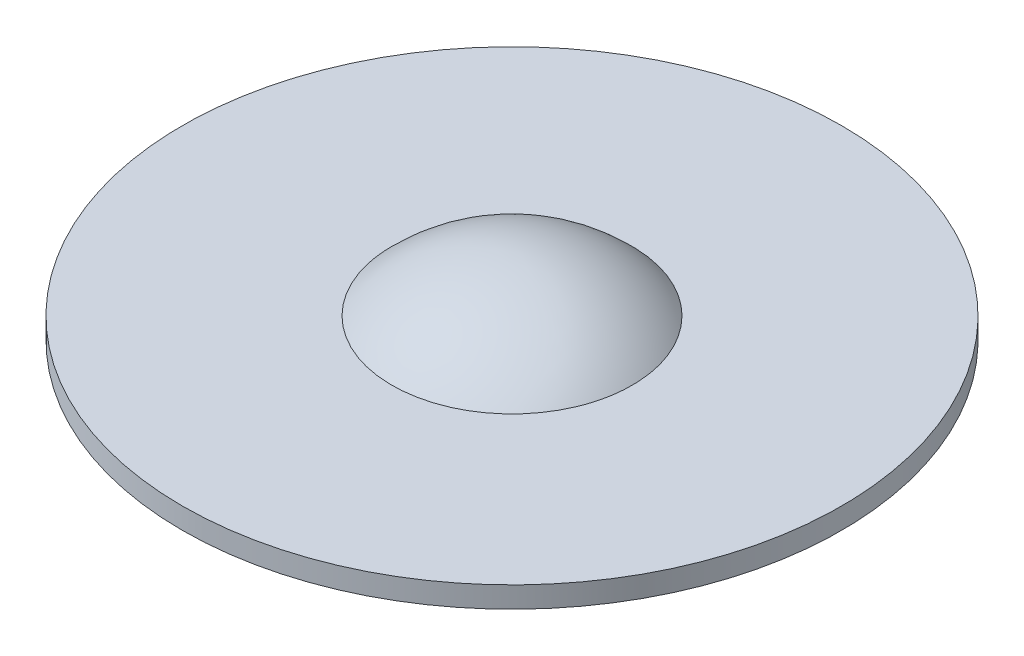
ISO-10303-21;
HEADER;
FILE_DESCRIPTION(('STEP AP214'),'2;1');
FILE_NAME('part.step','',(''),(''),'','','');
FILE_SCHEMA(('AUTOMOTIVE_DESIGN { 1 0 10303 214 1 1 1 1 }'));
ENDSEC;
DATA;
#1=APPLICATION_CONTEXT('core data for automotive mechanical design processes');
#2=APPLICATION_PROTOCOL_DEFINITION('international standard','automotive_design',2000,#1);
#3=PRODUCT_CONTEXT('',#1,'mechanical');
#4=PRODUCT('Part','Part','',(#3));
#5=PRODUCT_RELATED_PRODUCT_CATEGORY('part','',(#4));
#6=PRODUCT_DEFINITION_FORMATION('','',#4);
#7=PRODUCT_DEFINITION_CONTEXT('part definition',#1,'design');
#8=PRODUCT_DEFINITION('design','',#6,#7);
#9=PRODUCT_DEFINITION_SHAPE('','',#8);
#10=(LENGTH_UNIT() NAMED_UNIT(*) SI_UNIT(.MILLI.,.METRE.));
#11=(NAMED_UNIT(*) PLANE_ANGLE_UNIT() SI_UNIT($,.RADIAN.));
#12=(NAMED_UNIT(*) SI_UNIT($,.STERADIAN.) SOLID_ANGLE_UNIT());
#13=UNCERTAINTY_MEASURE_WITH_UNIT(LENGTH_MEASURE(1.E-05),#10,'distance_accuracy_value','');
#14=(GEOMETRIC_REPRESENTATION_CONTEXT(3) GLOBAL_UNCERTAINTY_ASSIGNED_CONTEXT((#13)) GLOBAL_UNIT_ASSIGNED_CONTEXT((#10,
#11,#12)) REPRESENTATION_CONTEXT('',''));
#15=CARTESIAN_POINT('',(0.,0.,0.));
#16=DIRECTION('',(0.,0.,1.));
#17=DIRECTION('',(1.,0.,0.));
#18=AXIS2_PLACEMENT_3D('',#15,#16,#17);
#19=CARTESIAN_POINT('',(0.,-5.65785,0.));
#20=DIRECTION('',(-1.,0.,0.));
#21=DIRECTION('',(0.,-1.,0.));
#22=AXIS2_PLACEMENT_3D('',#19,#20,#21);
#23=SPHERICAL_SURFACE('',#22,8.09625);
#24=CARTESIAN_POINT('',(-5.7912,0.,0.));
#25=CARTESIAN_POINT('',(-5.79119910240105,0.,0.162598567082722));
#26=CARTESIAN_POINT('',(-5.78434639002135,0.,0.32522660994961));
#27=CARTESIAN_POINT('',(-5.75697796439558,0.,0.649361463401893));
#28=CARTESIAN_POINT('',(-5.73645821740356,0.,0.810867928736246));
#29=CARTESIAN_POINT('',(-5.68185489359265,0.,1.13184036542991));
#30=CARTESIAN_POINT('',(-5.64774978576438,0.,1.29130268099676));
#31=CARTESIAN_POINT('',(-5.56618536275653,0.,1.60691198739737));
#32=CARTESIAN_POINT('',(-5.51871521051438,0.,1.76305617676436));
#33=CARTESIAN_POINT('',(-5.41086384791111,0.,2.07051806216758));
#34=CARTESIAN_POINT('',(-5.35050500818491,0.,2.22184360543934));
#35=CARTESIAN_POINT('',(-5.21722666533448,0.,2.51894082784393));
#36=CARTESIAN_POINT('',(-5.14430148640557,0.,2.66470996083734));
#37=CARTESIAN_POINT('',(-4.98642501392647,0.,2.94959055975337));
#38=CARTESIAN_POINT('',(-4.90147326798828,0.,3.0887017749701));
#39=CARTESIAN_POINT('',(-4.72019101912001,0.,3.35920998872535));
#40=CARTESIAN_POINT('',(-4.62386567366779,0.,3.49061044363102));
#41=CARTESIAN_POINT('',(-4.42042422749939,0.,3.74491372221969));
#42=CARTESIAN_POINT('',(-4.3133011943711,0.,3.86781100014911));
#43=CARTESIAN_POINT('',(-4.08918681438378,0.,4.10402599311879));
#44=CARTESIAN_POINT('',(-3.97220508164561,0.,4.21735283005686));
#45=CARTESIAN_POINT('',(-3.72905996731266,0.,4.43380353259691));
#46=CARTESIAN_POINT('',(-3.60289245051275,0.,4.5369227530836));
#47=CARTESIAN_POINT('',(-3.34228926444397,0.,4.7321894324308));
#48=CARTESIAN_POINT('',(-3.20785168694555,0.,4.8243343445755));
#49=CARTESIAN_POINT('',(-2.93173754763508,0.,4.99694020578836));
#50=CARTESIAN_POINT('',(-2.79006344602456,0.,5.07740509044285));
#51=CARTESIAN_POINT('',(-2.50038788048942,0.,5.22614354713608));
#52=CARTESIAN_POINT('',(-2.35238410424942,0.,5.29441261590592));
#53=CARTESIAN_POINT('',(-2.05120825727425,0.,5.41821376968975));
#54=CARTESIAN_POINT('',(-1.89803818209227,0.,5.47375070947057));
#55=CARTESIAN_POINT('',(-1.58750642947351,0.,5.57174468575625));
#56=CARTESIAN_POINT('',(-1.43014320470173,0.,5.61419681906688));
#57=CARTESIAN_POINT('',(-1.1124643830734,0.,5.68567647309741));
#58=CARTESIAN_POINT('',(-0.952150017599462,0.,5.71470946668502));
#59=CARTESIAN_POINT('',(-0.629572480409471,0.,5.75918018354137));
#60=CARTESIAN_POINT('',(-0.467308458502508,0.,5.77461174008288));
#61=CARTESIAN_POINT('',(-0.142057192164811,0.,5.79174737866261));
#62=CARTESIAN_POINT('',(0.0209300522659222,0.,5.79345146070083));
#63=CARTESIAN_POINT('',(0.346394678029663,0.,5.78312239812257));
#64=CARTESIAN_POINT('',(0.508872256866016,0.,5.77109547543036));
#65=CARTESIAN_POINT('',(0.832303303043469,0.,5.73339225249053));
#66=CARTESIAN_POINT('',(0.993256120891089,0.,5.70771038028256));
#67=CARTESIAN_POINT('',(1.3123657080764,0.,5.64288862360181));
#68=CARTESIAN_POINT('',(1.47052350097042,0.,5.60375377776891));
#69=CARTESIAN_POINT('',(1.78304071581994,0.,5.51228461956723));
#70=CARTESIAN_POINT('',(1.9373986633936,0.,5.45994526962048));
#71=CARTESIAN_POINT('',(2.2410995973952,0.,5.34246844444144));
#72=CARTESIAN_POINT('',(2.39044441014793,0.,5.27733569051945));
#73=CARTESIAN_POINT('',(2.68316690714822,0.,5.13469859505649));
#74=CARTESIAN_POINT('',(2.82654255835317,0.,5.05719008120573));
#75=CARTESIAN_POINT('',(3.10622109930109,0.,4.89038777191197));
#76=CARTESIAN_POINT('',(3.24252561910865,0.,4.80109670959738));
#77=CARTESIAN_POINT('',(3.50706868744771,0.,4.61139320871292));
#78=CARTESIAN_POINT('',(3.6353108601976,0.,4.5109858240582));
#79=CARTESIAN_POINT('',(3.88300531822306,0.,4.29962775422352));
#80=CARTESIAN_POINT('',(4.00244900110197,0.,4.18866698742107));
#81=CARTESIAN_POINT('',(4.23148563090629,0.,3.95714851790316));
#82=CARTESIAN_POINT('',(4.34108488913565,0.,3.83659705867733));
#83=CARTESIAN_POINT('',(4.54978775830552,0.,3.58663494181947));
#84=CARTESIAN_POINT('',(4.64888660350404,0.,3.45722030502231));
#85=CARTESIAN_POINT('',(4.83582347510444,0.,3.19050595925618));
#86=CARTESIAN_POINT('',(4.92366192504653,0.,3.05320654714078));
#87=CARTESIAN_POINT('',(5.08742052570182,0.,2.77175851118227));
#88=CARTESIAN_POINT('',(5.16334605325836,0.,2.62761301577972));
#89=CARTESIAN_POINT('',(5.30290752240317,0.,2.33318590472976));
#90=CARTESIAN_POINT('',(5.36652204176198,0.,2.18289413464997));
#91=CARTESIAN_POINT('',(5.48079819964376,0.,1.87760255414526));
#92=CARTESIAN_POINT('',(5.53147032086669,0.,1.7226066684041));
#93=CARTESIAN_POINT('',(5.61949817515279,0.,1.4091486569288));
#94=CARTESIAN_POINT('',(5.65687493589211,0.,1.25069242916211));
#95=CARTESIAN_POINT('',(5.7181509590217,0.,0.931227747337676));
#96=CARTESIAN_POINT('',(5.74205419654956,0.,0.770220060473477));
#97=CARTESIAN_POINT('',(5.76981845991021,0.,0.50746880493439));
#98=CARTESIAN_POINT('',(5.77783403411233,0.,0.40614614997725));
#99=CARTESIAN_POINT('',(5.78852508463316,0.,0.20321950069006));
#100=CARTESIAN_POINT('',(5.79120056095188,0.,0.101615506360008));
#101=CARTESIAN_POINT('',(5.79119910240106,0.,-0.16259856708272));
#102=CARTESIAN_POINT('',(5.78434639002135,0.,-0.325226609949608));
#103=CARTESIAN_POINT('',(5.75697796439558,0.,-0.649361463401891));
#104=CARTESIAN_POINT('',(5.73645821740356,0.,-0.810867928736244));
#105=CARTESIAN_POINT('',(5.68185489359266,0.,-1.1318403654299));
#106=CARTESIAN_POINT('',(5.64774978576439,0.,-1.29130268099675));
#107=CARTESIAN_POINT('',(5.56618536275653,0.,-1.60691198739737));
#108=CARTESIAN_POINT('',(5.51871521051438,0.,-1.76305617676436));
#109=CARTESIAN_POINT('',(5.41086384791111,0.,-2.07051806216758));
#110=CARTESIAN_POINT('',(5.35050500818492,0.,-2.22184360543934));
#111=CARTESIAN_POINT('',(5.21722666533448,0.,-2.51894082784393));
#112=CARTESIAN_POINT('',(5.14430148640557,0.,-2.66470996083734));
#113=CARTESIAN_POINT('',(4.98642501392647,0.,-2.94959055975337));
#114=CARTESIAN_POINT('',(4.90147326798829,0.,-3.0887017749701));
#115=CARTESIAN_POINT('',(4.72019101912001,0.,-3.35920998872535));
#116=CARTESIAN_POINT('',(4.62386567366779,0.,-3.49061044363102));
#117=CARTESIAN_POINT('',(4.42042422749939,0.,-3.74491372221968));
#118=CARTESIAN_POINT('',(4.3133011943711,0.,-3.8678110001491));
#119=CARTESIAN_POINT('',(4.08918681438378,0.,-4.10402599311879));
#120=CARTESIAN_POINT('',(3.97220508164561,0.,-4.21735283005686));
#121=CARTESIAN_POINT('',(3.72905996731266,0.,-4.43380353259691));
#122=CARTESIAN_POINT('',(3.60289245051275,0.,-4.53692275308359));
#123=CARTESIAN_POINT('',(3.34228926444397,0.,-4.7321894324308));
#124=CARTESIAN_POINT('',(3.20785168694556,0.,-4.8243343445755));
#125=CARTESIAN_POINT('',(2.93173754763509,0.,-4.99694020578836));
#126=CARTESIAN_POINT('',(2.79006344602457,0.,-5.07740509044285));
#127=CARTESIAN_POINT('',(2.50038788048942,0.,-5.22614354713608));
#128=CARTESIAN_POINT('',(2.35238410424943,0.,-5.29441261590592));
#129=CARTESIAN_POINT('',(2.05120825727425,0.,-5.41821376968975));
#130=CARTESIAN_POINT('',(1.89803818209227,0.,-5.47375070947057));
#131=CARTESIAN_POINT('',(1.58750642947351,0.,-5.57174468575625));
#132=CARTESIAN_POINT('',(1.43014320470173,0.,-5.61419681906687));
#133=CARTESIAN_POINT('',(1.1124643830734,0.,-5.68567647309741));
#134=CARTESIAN_POINT('',(0.952150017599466,0.,-5.71470946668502));
#135=CARTESIAN_POINT('',(0.629572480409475,0.,-5.75918018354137));
#136=CARTESIAN_POINT('',(0.467308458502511,0.,-5.77461174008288));
#137=CARTESIAN_POINT('',(0.142057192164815,0.,-5.79174737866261));
#138=CARTESIAN_POINT('',(-0.0209300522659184,0.,-5.79345146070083));
#139=CARTESIAN_POINT('',(-0.346394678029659,0.,-5.78312239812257));
#140=CARTESIAN_POINT('',(-0.508872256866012,0.,-5.77109547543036));
#141=CARTESIAN_POINT('',(-0.832303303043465,0.,-5.73339225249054));
#142=CARTESIAN_POINT('',(-0.993256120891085,0.,-5.70771038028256));
#143=CARTESIAN_POINT('',(-1.3123657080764,0.,-5.64288862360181));
#144=CARTESIAN_POINT('',(-1.47052350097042,0.,-5.60375377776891));
#145=CARTESIAN_POINT('',(-1.78304071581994,0.,-5.51228461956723));
#146=CARTESIAN_POINT('',(-1.93739866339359,0.,-5.45994526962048));
#147=CARTESIAN_POINT('',(-2.2410995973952,0.,-5.34246844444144));
#148=CARTESIAN_POINT('',(-2.39044441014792,0.,-5.27733569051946));
#149=CARTESIAN_POINT('',(-2.68316690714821,0.,-5.13469859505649));
#150=CARTESIAN_POINT('',(-2.82654255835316,0.,-5.05719008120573));
#151=CARTESIAN_POINT('',(-3.10622109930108,0.,-4.89038777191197));
#152=CARTESIAN_POINT('',(-3.24252561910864,0.,-4.80109670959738));
#153=CARTESIAN_POINT('',(-3.5070686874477,0.,-4.61139320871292));
#154=CARTESIAN_POINT('',(-3.6353108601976,0.,-4.51098582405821));
#155=CARTESIAN_POINT('',(-3.88300531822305,0.,-4.29962775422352));
#156=CARTESIAN_POINT('',(-4.00244900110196,0.,-4.18866698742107));
#157=CARTESIAN_POINT('',(-4.23148563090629,0.,-3.95714851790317));
#158=CARTESIAN_POINT('',(-4.34108488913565,0.,-3.83659705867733));
#159=CARTESIAN_POINT('',(-4.54978775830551,0.,-3.58663494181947));
#160=CARTESIAN_POINT('',(-4.64888660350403,0.,-3.45722030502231));
#161=CARTESIAN_POINT('',(-4.83582347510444,0.,-3.19050595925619));
#162=CARTESIAN_POINT('',(-4.92366192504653,0.,-3.05320654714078));
#163=CARTESIAN_POINT('',(-5.08742052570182,0.,-2.77175851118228));
#164=CARTESIAN_POINT('',(-5.16334605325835,0.,-2.62761301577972));
#165=CARTESIAN_POINT('',(-5.30290752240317,0.,-2.33318590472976));
#166=CARTESIAN_POINT('',(-5.36652204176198,0.,-2.18289413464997));
#167=CARTESIAN_POINT('',(-5.48079819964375,0.,-1.87760255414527));
#168=CARTESIAN_POINT('',(-5.53147032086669,0.,-1.7226066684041));
#169=CARTESIAN_POINT('',(-5.61949817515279,0.,-1.4091486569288));
#170=CARTESIAN_POINT('',(-5.65687493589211,0.,-1.25069242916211));
#171=CARTESIAN_POINT('',(-5.71815095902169,0.,-0.931227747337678));
#172=CARTESIAN_POINT('',(-5.74205419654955,0.,-0.770220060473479));
#173=CARTESIAN_POINT('',(-5.76981845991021,0.,-0.507468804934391));
#174=CARTESIAN_POINT('',(-5.77783403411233,0.,-0.406146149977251));
#175=CARTESIAN_POINT('',(-5.78852508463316,0.,-0.203219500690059));
#176=CARTESIAN_POINT('',(-5.79120056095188,0.,-0.101615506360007));
#177=CARTESIAN_POINT('',(-5.7912,0.,0.));
#178=B_SPLINE_CURVE_WITH_KNOTS('',3,(#24,#25,#26,#27,#28,#29,#30,#31,#32,#33,#34,#35,#36,#37,
#38,#39,#40,#41,#42,#43,#44,#45,#46,#47,#48,#49,#50,#51,#52,#53,#54,#55,#56,#57,#58,#59,#60,#61,
#62,#63,#64,#65,#66,#67,#68,#69,#70,#71,#72,#73,#74,#75,#76,#77,#78,#79,#80,#81,#82,#83,#84,#85,
#86,#87,#88,#89,#90,#91,#92,#93,#94,#95,#96,#97,#98,#99,#100,#101,#102,#103,#104,#105,#106,#107,
#108,#109,#110,#111,#112,#113,#114,#115,#116,#117,#118,#119,#120,#121,#122,#123,#124,#125,#126,
#127,#128,#129,#130,#131,#132,#133,#134,#135,#136,#137,#138,#139,#140,#141,#142,#143,#144,#145,
#146,#147,#148,#149,#150,#151,#152,#153,#154,#155,#156,#157,#158,#159,#160,#161,#162,#163,#164,
#165,#166,#167,#168,#169,#170,#171,#172,#173,#174,#175,#176,#177),.UNSPECIFIED.,.T.,.F.,(4,2,2,
2,2,2,2,2,2,2,2,2,2,2,2,2,2,2,2,2,2,2,2,2,2,2,2,2,2,2,2,2,2,2,2,2,2,2,2,2,2,2,2,2,2,2,2,2,2,2,2,
2,2,2,2,2,2,2,2,2,2,2,2,2,2,2,2,2,2,2,2,2,2,2,2,2,4),(0.,0.487702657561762,0.975549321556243,
1.46417225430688,1.95319253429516,2.44137083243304,2.92977020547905,3.41818795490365,
3.90638507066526,4.39489764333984,4.88293921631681,5.37120186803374,5.85957760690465,
6.34778840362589,6.83617909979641,7.32438326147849,7.81277014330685,8.3009576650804,
8.78936641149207,9.27777515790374,9.76596267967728,10.2543495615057,10.7425537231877,
11.2309444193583,11.7191552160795,12.2075309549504,12.6957936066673,13.1838351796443,
13.6723477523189,14.1605448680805,14.6489626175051,15.1373619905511,15.625540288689,
16.1145605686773,16.6031835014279,17.0910301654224,17.5787328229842,17.8835211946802,
18.1883095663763,18.6760122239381,19.1638588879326,19.6524818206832,20.1415021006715,
20.6296803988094,21.1180797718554,21.60649752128,22.0946946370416,22.5832072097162,
23.0712487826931,23.5595114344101,24.047887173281,24.5360979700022,25.0244886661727,
25.5126928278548,26.0010797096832,26.4892672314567,26.9776759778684,27.4660847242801,
27.9542722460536,28.442659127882,28.9308632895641,29.4192539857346,29.9074647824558,
30.3958405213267,30.8841031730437,31.3721447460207,31.8606573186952,32.3488544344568,
32.8372721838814,33.3256715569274,33.8138498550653,34.3028701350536,34.7914930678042,
35.2793397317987,35.7670423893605,36.0718307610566,36.3766191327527),.UNSPECIFIED.);
#179=CARTESIAN_POINT('',(-5.7912,0.,0.));
#180=VERTEX_POINT('',#179);
#181=EDGE_CURVE('E21',#180,#180,#178,.T.);
#182=ORIENTED_EDGE('',*,*,#181,.T.);
#183=EDGE_LOOP('',(#182));
#184=FACE_BOUND('',#183,.T.);
#185=ADVANCED_FACE('F16',(#184),#23,.T.);
#186=CARTESIAN_POINT('',(-15.875,0.,0.));
#187=DIRECTION('',(0.,-1.,0.));
#188=DIRECTION('',(0.,0.,-1.));
#189=AXIS2_PLACEMENT_3D('',#186,#187,#188);
#190=PLANE('',#189);
#191=CARTESIAN_POINT('',(0.,0.,0.));
#192=DIRECTION('',(0.,1.,0.));
#193=DIRECTION('',(0.,0.,1.));
#194=AXIS2_PLACEMENT_3D('',#191,#192,#193);
#195=CIRCLE('',#194,15.875);
#196=CARTESIAN_POINT('',(0.,0.,15.875));
#197=VERTEX_POINT('',#196);
#198=EDGE_CURVE('E33',#197,#197,#195,.F.);
#199=ORIENTED_EDGE('',*,*,#198,.F.);
#200=EDGE_LOOP('',(#199));
#201=FACE_BOUND('',#200,.T.);
#202=ORIENTED_EDGE('',*,*,#181,.F.);
#203=EDGE_LOOP('',(#202));
#204=FACE_BOUND('',#203,.T.);
#205=ADVANCED_FACE('F55',(#201,#204),#190,.F.);
#206=CARTESIAN_POINT('',(0.,-5.65785,0.));
#207=DIRECTION('',(-1.,0.,0.));
#208=DIRECTION('',(0.,-1.,0.));
#209=AXIS2_PLACEMENT_3D('',#206,#207,#208);
#210=SPHERICAL_SURFACE('',#209,7.08025);
#211=CARTESIAN_POINT('',(-5.34632290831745,-1.016,0.));
#212=CARTESIAN_POINT('',(-5.34632200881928,-1.016,0.150107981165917));
#213=CARTESIAN_POINT('',(-5.33999541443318,-1.016,0.300243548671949));
#214=CARTESIAN_POINT('',(-5.31473016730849,-1.016,0.599477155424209));
#215=CARTESIAN_POINT('',(-5.29578779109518,-1.016,0.748574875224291));
#216=CARTESIAN_POINT('',(-5.24537620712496,-1.016,1.04489554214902));
#217=CARTESIAN_POINT('',(-5.21388711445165,-1.016,1.19211512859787));
#218=CARTESIAN_POINT('',(-5.13859914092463,-1.016,1.4834601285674));
#219=CARTESIAN_POINT('',(-5.09479027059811,-1.016,1.62758292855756));
#220=CARTESIAN_POINT('',(-4.94548976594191,-1.016,2.05314518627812));
#221=CARTESIAN_POINT('',(-4.82200160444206,-1.016,2.32849468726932));
#222=CARTESIAN_POINT('',(-4.53048474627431,-1.016,2.85452312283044));
#223=CARTESIAN_POINT('',(-4.36245435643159,-1.016,3.10520111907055));
#224=CARTESIAN_POINT('',(-4.08082940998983,-1.016,3.45726739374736));
#225=CARTESIAN_POINT('',(-3.98195018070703,-1.016,3.57069735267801));
#226=CARTESIAN_POINT('',(-3.77506289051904,-1.016,3.78874711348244));
#227=CARTESIAN_POINT('',(-3.66706372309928,-1.016,3.89337530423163));
#228=CARTESIAN_POINT('',(-3.44259399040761,-1.016,4.09320354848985));
#229=CARTESIAN_POINT('',(-3.32611960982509,-1.016,4.18839930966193));
#230=CARTESIAN_POINT('',(-3.08553671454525,-1.016,4.36866430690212));
#231=CARTESIAN_POINT('',(-2.96142643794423,-1.016,4.45373119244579));
#232=CARTESIAN_POINT('',(-2.70652261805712,-1.016,4.6130779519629));
#233=CARTESIAN_POINT('',(-2.57573134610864,-1.016,4.68736145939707));
#234=CARTESIAN_POINT('',(-2.30831015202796,-1.016,4.82467371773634));
#235=CARTESIAN_POINT('',(-2.17167809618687,-1.016,4.88769831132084));
#236=CARTESIAN_POINT('',(-1.89363249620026,-1.016,5.00198946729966));
#237=CARTESIAN_POINT('',(-1.75222079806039,-1.01599999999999,5.05326051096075));
#238=CARTESIAN_POINT('',(-1.46556600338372,-1.01600000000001,5.14372544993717));
#239=CARTESIAN_POINT('',(-1.32032149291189,-1.01600000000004,5.18291481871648));
#240=CARTESIAN_POINT('',(-0.880509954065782,-1.01600000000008,5.28185390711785));
#241=CARTESIAN_POINT('',(-0.581563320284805,-1.01600000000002,5.32309822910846));
#242=CARTESIAN_POINT('',(0.0190088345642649,-1.01599999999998,5.35473895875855));
#243=CARTESIAN_POINT('',(0.320634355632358,-1.01600000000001,5.34513536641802));
#244=CARTESIAN_POINT('',(0.768407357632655,-1.01600000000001,5.29295805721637));
#245=CARTESIAN_POINT('',(0.916965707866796,-1.016,5.26924748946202));
#246=CARTESIAN_POINT('',(1.2115393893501,-1.016,5.20940417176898));
#247=CARTESIAN_POINT('',(1.35755565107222,-1.016,5.17327607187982));
#248=CARTESIAN_POINT('',(1.64607138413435,-1.016,5.08883380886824));
#249=CARTESIAN_POINT('',(1.78856949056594,-1.016,5.04051499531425));
#250=CARTESIAN_POINT('',(2.06893862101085,-1.016,4.93206269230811));
#251=CARTESIAN_POINT('',(2.20681133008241,-1.01600000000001,4.87193356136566));
#252=CARTESIAN_POINT('',(2.4770476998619,-1.01600000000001,4.74025345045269));
#253=CARTESIAN_POINT('',(2.60940948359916,-1.016,4.66869861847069));
#254=CARTESIAN_POINT('',(2.86760223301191,-1.016,4.5147112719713));
#255=CARTESIAN_POINT('',(2.99343470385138,-1.016,4.43228128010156));
#256=CARTESIAN_POINT('',(3.23765913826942,-1.016,4.25714586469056));
#257=CARTESIAN_POINT('',(3.35605444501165,-1.016,4.16444511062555));
#258=CARTESIAN_POINT('',(3.58470843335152,-1.016,3.96934154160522));
#259=CARTESIAN_POINT('',(3.69495915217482,-1.01600000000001,3.8669294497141));
#260=CARTESIAN_POINT('',(4.01201910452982,-1.01600000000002,3.54640447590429));
#261=CARTESIAN_POINT('',(4.20545977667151,-1.016,3.31477033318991));
#262=CARTESIAN_POINT('',(4.55063629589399,-1.016,2.82228564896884));
#263=CARTESIAN_POINT('',(4.70237372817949,-1.016,2.56143621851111));
#264=CARTESIAN_POINT('',(4.89556450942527,-1.016,2.15391787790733));
#265=CARTESIAN_POINT('',(4.95427484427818,-1.016,2.01519623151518));
#266=CARTESIAN_POINT('',(5.05975967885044,-1.016,1.73337512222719));
#267=CARTESIAN_POINT('',(5.10654383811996,-1.016,1.5902793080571));
#268=CARTESIAN_POINT('',(5.1878128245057,-1.016,1.30089614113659));
#269=CARTESIAN_POINT('',(5.22231707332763,-1.016,1.15461421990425));
#270=CARTESIAN_POINT('',(5.27888501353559,-1.016,0.859691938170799));
#271=CARTESIAN_POINT('',(5.30095237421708,-1.016,0.711052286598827));
#272=CARTESIAN_POINT('',(5.32658394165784,-1.016,0.468485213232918));
#273=CARTESIAN_POINT('',(5.33398371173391,-1.016,0.374946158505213));
#274=CARTESIAN_POINT('',(5.34385347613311,-1.016,0.187608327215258));
#275=CARTESIAN_POINT('',(5.34632347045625,-1.016,0.0938095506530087));
#276=CARTESIAN_POINT('',(5.34632200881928,-1.016,-0.150107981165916));
#277=CARTESIAN_POINT('',(5.33999541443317,-1.016,-0.300243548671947));
#278=CARTESIAN_POINT('',(5.31473016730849,-1.016,-0.599477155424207));
#279=CARTESIAN_POINT('',(5.29578779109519,-1.016,-0.74857487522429));
#280=CARTESIAN_POINT('',(5.24537620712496,-1.016,-1.04489554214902));
#281=CARTESIAN_POINT('',(5.21388711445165,-1.016,-1.19211512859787));
#282=CARTESIAN_POINT('',(5.13859914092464,-1.016,-1.4834601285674));
#283=CARTESIAN_POINT('',(5.09479027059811,-1.016,-1.62758292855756));
#284=CARTESIAN_POINT('',(4.94548976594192,-1.016,-2.05314518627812));
#285=CARTESIAN_POINT('',(4.82200160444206,-1.016,-2.32849468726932));
#286=CARTESIAN_POINT('',(4.53048474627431,-1.016,-2.85452312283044));
#287=CARTESIAN_POINT('',(4.3624543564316,-1.016,-3.10520111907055));
#288=CARTESIAN_POINT('',(4.08082940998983,-1.016,-3.45726739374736));
#289=CARTESIAN_POINT('',(3.98195018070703,-1.016,-3.57069735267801));
#290=CARTESIAN_POINT('',(3.77506289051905,-1.016,-3.78874711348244));
#291=CARTESIAN_POINT('',(3.66706372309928,-1.016,-3.89337530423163));
#292=CARTESIAN_POINT('',(3.44259399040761,-1.016,-4.09320354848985));
#293=CARTESIAN_POINT('',(3.3261196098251,-1.016,-4.18839930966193));
#294=CARTESIAN_POINT('',(3.08553671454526,-1.016,-4.36866430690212));
#295=CARTESIAN_POINT('',(2.96142643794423,-1.016,-4.45373119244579));
#296=CARTESIAN_POINT('',(2.70652261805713,-1.016,-4.6130779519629));
#297=CARTESIAN_POINT('',(2.57573134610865,-1.016,-4.68736145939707));
#298=CARTESIAN_POINT('',(2.30831015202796,-1.016,-4.82467371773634));
#299=CARTESIAN_POINT('',(2.17167809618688,-1.016,-4.88769831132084));
#300=CARTESIAN_POINT('',(1.89363249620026,-1.016,-5.00198946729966));
#301=CARTESIAN_POINT('',(1.75222079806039,-1.01599999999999,-5.05326051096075));
#302=CARTESIAN_POINT('',(1.46556600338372,-1.01600000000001,-5.14372544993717));
#303=CARTESIAN_POINT('',(1.32032149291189,-1.01600000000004,-5.18291481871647));
#304=CARTESIAN_POINT('',(0.880509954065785,-1.01600000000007,-5.28185390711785));
#305=CARTESIAN_POINT('',(0.581563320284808,-1.01600000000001,-5.32309822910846));
#306=CARTESIAN_POINT('',(-0.0190088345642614,-1.01599999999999,-5.35473895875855));
#307=CARTESIAN_POINT('',(-0.320634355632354,-1.01600000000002,-5.34513536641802));
#308=CARTESIAN_POINT('',(-0.768407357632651,-1.01600000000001,-5.29295805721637));
#309=CARTESIAN_POINT('',(-0.916965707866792,-1.016,-5.26924748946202));
#310=CARTESIAN_POINT('',(-1.2115393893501,-1.016,-5.20940417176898));
#311=CARTESIAN_POINT('',(-1.35755565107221,-1.016,-5.17327607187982));
#312=CARTESIAN_POINT('',(-1.64607138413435,-1.016,-5.08883380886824));
#313=CARTESIAN_POINT('',(-1.78856949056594,-1.016,-5.04051499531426));
#314=CARTESIAN_POINT('',(-2.06893862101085,-1.016,-4.93206269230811));
#315=CARTESIAN_POINT('',(-2.20681133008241,-1.01600000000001,-4.87193356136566));
#316=CARTESIAN_POINT('',(-2.47704769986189,-1.01600000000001,-4.74025345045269));
#317=CARTESIAN_POINT('',(-2.60940948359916,-1.016,-4.66869861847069));
#318=CARTESIAN_POINT('',(-2.8676022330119,-1.016,-4.5147112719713));
#319=CARTESIAN_POINT('',(-2.99343470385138,-1.016,-4.43228128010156));
#320=CARTESIAN_POINT('',(-3.23765913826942,-1.016,-4.25714586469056));
#321=CARTESIAN_POINT('',(-3.35605444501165,-1.016,-4.16444511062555));
#322=CARTESIAN_POINT('',(-3.58470843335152,-1.016,-3.96934154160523));
#323=CARTESIAN_POINT('',(-3.69495915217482,-1.01600000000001,-3.8669294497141));
#324=CARTESIAN_POINT('',(-4.01201910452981,-1.01600000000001,-3.54640447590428));
#325=CARTESIAN_POINT('',(-4.2054597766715,-1.016,-3.31477033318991));
#326=CARTESIAN_POINT('',(-4.55063629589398,-1.016,-2.82228564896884));
#327=CARTESIAN_POINT('',(-4.70237372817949,-1.016,-2.56143621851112));
#328=CARTESIAN_POINT('',(-4.89556450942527,-1.016,-2.15391787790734));
#329=CARTESIAN_POINT('',(-4.95427484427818,-1.016,-2.01519623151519));
#330=CARTESIAN_POINT('',(-5.05975967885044,-1.016,-1.73337512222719));
#331=CARTESIAN_POINT('',(-5.10654383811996,-1.016,-1.5902793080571));
#332=CARTESIAN_POINT('',(-5.1878128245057,-1.016,-1.3008961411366));
#333=CARTESIAN_POINT('',(-5.22231707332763,-1.016,-1.15461421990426));
#334=CARTESIAN_POINT('',(-5.27888501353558,-1.016,-0.859691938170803));
#335=CARTESIAN_POINT('',(-5.30095237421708,-1.016,-0.711052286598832));
#336=CARTESIAN_POINT('',(-5.32658394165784,-1.016,-0.468485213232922));
#337=CARTESIAN_POINT('',(-5.3339837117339,-1.016,-0.374946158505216));
#338=CARTESIAN_POINT('',(-5.34385347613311,-1.016,-0.187608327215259));
#339=CARTESIAN_POINT('',(-5.34632347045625,-1.016,-0.0938095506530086));
#340=CARTESIAN_POINT('',(-5.34632290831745,-1.016,0.));
#341=B_SPLINE_CURVE_WITH_KNOTS('',3,(#211,#212,#213,#214,#215,#216,#217,#218,#219,#220,#221,
#222,#223,#224,#225,#226,#227,#228,#229,#230,#231,#232,#233,#234,#235,#236,#237,#238,#239,#240,
#241,#242,#243,#244,#245,#246,#247,#248,#249,#250,#251,#252,#253,#254,#255,#256,#257,#258,#259,
#260,#261,#262,#263,#264,#265,#266,#267,#268,#269,#270,#271,#272,#273,#274,#275,#276,#277,#278,
#279,#280,#281,#282,#283,#284,#285,#286,#287,#288,#289,#290,#291,#292,#293,#294,#295,#296,#297,
#298,#299,#300,#301,#302,#303,#304,#305,#306,#307,#308,#309,#310,#311,#312,#313,#314,#315,#316,
#317,#318,#319,#320,#321,#322,#323,#324,#325,#326,#327,#328,#329,#330,#331,#332,#333,#334,#335,
#336,#337,#338,#339,#340),.UNSPECIFIED.,.T.,.F.,(4,2,2,2,2,2,2,2,2,2,2,2,2,2,2,2,2,2,2,2,2,2,2,
2,2,2,2,2,2,2,2,2,2,2,2,2,2,2,2,2,2,2,2,2,2,2,2,2,2,2,2,2,2,2,2,2,2,2,2,2,2,2,2,2,4),(0.,
0.450237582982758,0.900608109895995,1.35169527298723,1.80314925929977,2.70390520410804,
3.60469539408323,4.05568067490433,4.50623113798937,4.95698569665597,5.40784465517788,
5.85855134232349,6.30942410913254,6.76012468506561,7.21099391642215,8.11176698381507,
9.01254005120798,9.46340928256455,9.91410985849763,10.3649826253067,10.8156893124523,
11.2665482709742,11.7173028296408,12.1678532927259,12.618838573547,13.5196287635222,
14.4203847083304,14.871838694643,15.3229258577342,15.7732963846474,16.2235339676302,
16.504908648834,16.7862833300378,17.2365209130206,17.6868914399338,18.1379786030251,
18.5894325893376,19.4901885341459,20.3909787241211,20.8419640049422,21.2925144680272,
21.7432690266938,22.1941279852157,22.6448346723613,23.0957074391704,23.5464080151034,
23.99727724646,24.8980503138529,25.7988233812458,26.2496926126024,26.7003931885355,
27.1512659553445,27.6019726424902,28.0528316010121,28.5035861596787,28.9541366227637,
29.4051219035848,30.30591209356,31.2066680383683,31.6581220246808,32.109209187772,
32.5595797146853,33.009817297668,33.2911919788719,33.5725666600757),.UNSPECIFIED.);
#342=CARTESIAN_POINT('',(-5.34632290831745,-1.016,0.));
#343=VERTEX_POINT('',#342);
#344=EDGE_CURVE('E28',#343,#343,#341,.T.);
#345=ORIENTED_EDGE('',*,*,#344,.F.);
#346=EDGE_LOOP('',(#345));
#347=FACE_BOUND('',#346,.T.);
#348=ADVANCED_FACE('F42',(#347),#210,.F.);
#349=CARTESIAN_POINT('',(0.,0.,0.));
#350=DIRECTION('',(0.,1.,0.));
#351=DIRECTION('',(0.,0.,1.));
#352=AXIS2_PLACEMENT_3D('',#349,#350,#351);
#353=CYLINDRICAL_SURFACE('',#352,15.875);
#354=CARTESIAN_POINT('',(0.,-1.016,0.));
#355=DIRECTION('',(0.,1.,0.));
#356=DIRECTION('',(0.,0.,1.));
#357=AXIS2_PLACEMENT_3D('',#354,#355,#356);
#358=CIRCLE('',#357,15.875);
#359=CARTESIAN_POINT('',(0.,-1.016,15.875));
#360=VERTEX_POINT('',#359);
#361=EDGE_CURVE('E10',#360,#360,#358,.F.);
#362=ORIENTED_EDGE('',*,*,#361,.F.);
#363=EDGE_LOOP('',(#362));
#364=FACE_BOUND('',#363,.T.);
#365=ORIENTED_EDGE('',*,*,#198,.T.);
#366=EDGE_LOOP('',(#365));
#367=FACE_BOUND('',#366,.T.);
#368=ADVANCED_FACE('F48',(#364,#367),#353,.T.);
#369=CARTESIAN_POINT('',(-15.875,-1.016,0.));
#370=DIRECTION('',(0.,-1.,0.));
#371=DIRECTION('',(0.,0.,-1.));
#372=AXIS2_PLACEMENT_3D('',#369,#370,#371);
#373=PLANE('',#372);
#374=ORIENTED_EDGE('',*,*,#361,.T.);
#375=EDGE_LOOP('',(#374));
#376=FACE_BOUND('',#375,.T.);
#377=ORIENTED_EDGE('',*,*,#344,.T.);
#378=EDGE_LOOP('',(#377));
#379=FACE_BOUND('',#378,.T.);
#380=ADVANCED_FACE('F45',(#376,#379),#373,.T.);
#381=CLOSED_SHELL('',(#185,#205,#348,#368,#380));
#382=MANIFOLD_SOLID_BREP('B1',#381);
#383=ADVANCED_BREP_SHAPE_REPRESENTATION('',(#18,#382),#14);
#384=SHAPE_DEFINITION_REPRESENTATION(#9,#383);
ENDSEC;
END-ISO-10303-21;
